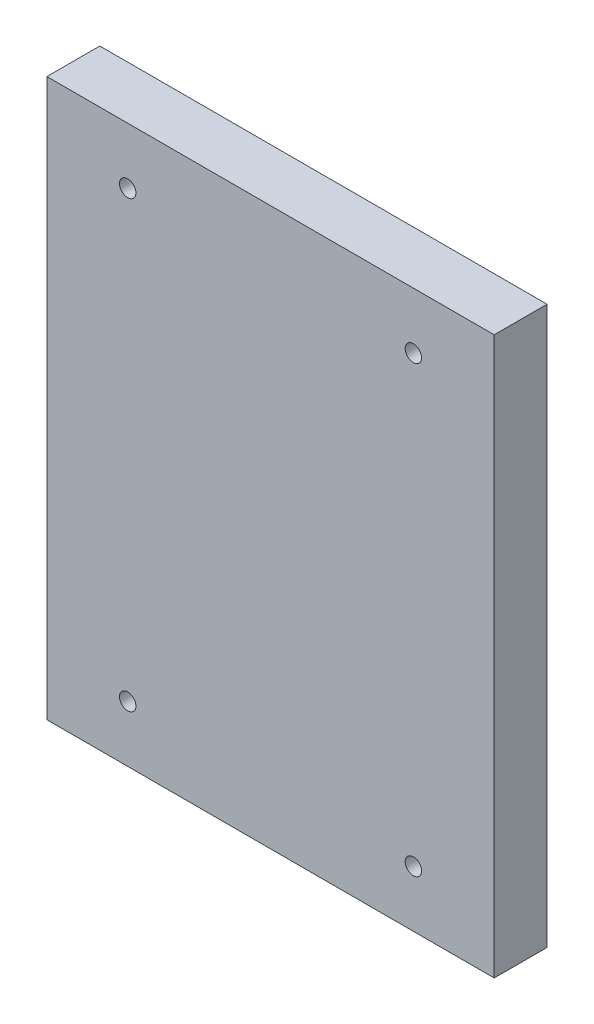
ISO-10303-21;
HEADER;
FILE_DESCRIPTION(('STEP AP214'),'2;1');
FILE_NAME('part.step','',(''),(''),'','','');
FILE_SCHEMA(('AUTOMOTIVE_DESIGN { 1 0 10303 214 1 1 1 1 }'));
ENDSEC;
DATA;
#1=APPLICATION_CONTEXT('core data for automotive mechanical design processes');
#2=APPLICATION_PROTOCOL_DEFINITION('international standard','automotive_design',2000,#1);
#3=PRODUCT_CONTEXT('',#1,'mechanical');
#4=PRODUCT('Part','Part','',(#3));
#5=PRODUCT_RELATED_PRODUCT_CATEGORY('part','',(#4));
#6=PRODUCT_DEFINITION_FORMATION('','',#4);
#7=PRODUCT_DEFINITION_CONTEXT('part definition',#1,'design');
#8=PRODUCT_DEFINITION('design','',#6,#7);
#9=PRODUCT_DEFINITION_SHAPE('','',#8);
#10=(LENGTH_UNIT() NAMED_UNIT(*) SI_UNIT(.MILLI.,.METRE.));
#11=(NAMED_UNIT(*) PLANE_ANGLE_UNIT() SI_UNIT($,.RADIAN.));
#12=(NAMED_UNIT(*) SI_UNIT($,.STERADIAN.) SOLID_ANGLE_UNIT());
#13=UNCERTAINTY_MEASURE_WITH_UNIT(LENGTH_MEASURE(1.E-05),#10,'distance_accuracy_value','');
#14=(GEOMETRIC_REPRESENTATION_CONTEXT(3) GLOBAL_UNCERTAINTY_ASSIGNED_CONTEXT((#13)) GLOBAL_UNIT_ASSIGNED_CONTEXT((#10,
#11,#12)) REPRESENTATION_CONTEXT('',''));
#15=CARTESIAN_POINT('',(0.,0.,0.));
#16=DIRECTION('',(0.,0.,1.));
#17=DIRECTION('',(1.,0.,0.));
#18=AXIS2_PLACEMENT_3D('',#15,#16,#17);
#19=CARTESIAN_POINT('',(0.,0.,10.));
#20=DIRECTION('',(0.,0.,1.));
#21=DIRECTION('',(1.,0.,0.));
#22=AXIS2_PLACEMENT_3D('',#19,#20,#21);
#23=PLANE('',#22);
#24=CARTESIAN_POINT('',(140.646889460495,2.2616220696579,10.));
#25=DIRECTION('',(0.,0.,1.));
#26=DIRECTION('',(1.,0.,0.));
#27=AXIS2_PLACEMENT_3D('',#24,#25,#26);
#28=CIRCLE('',#27,1.54999999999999);
#29=CARTESIAN_POINT('',(142.196889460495,2.2616220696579,10.));
#30=VERTEX_POINT('',#29);
#31=EDGE_CURVE('E121',#30,#30,#28,.T.);
#32=ORIENTED_EDGE('',*,*,#31,.F.);
#33=EDGE_LOOP('',(#32));
#34=FACE_BOUND('',#33,.T.);
#35=CARTESIAN_POINT('',(86.646889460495,86.2616220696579,10.));
#36=DIRECTION('',(0.,0.,1.));
#37=DIRECTION('',(1.,0.,0.));
#38=AXIS2_PLACEMENT_3D('',#35,#36,#37);
#39=CIRCLE('',#38,1.54999999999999);
#40=CARTESIAN_POINT('',(88.196889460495,86.2616220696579,10.));
#41=VERTEX_POINT('',#40);
#42=EDGE_CURVE('E100',#41,#41,#39,.T.);
#43=ORIENTED_EDGE('',*,*,#42,.F.);
#44=EDGE_LOOP('',(#43));
#45=FACE_BOUND('',#44,.T.);
#46=DIRECTION('',(0.,1.,0.));
#47=VECTOR('',#46,1.);
#48=CARTESIAN_POINT('',(155.921125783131,96.9072533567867,10.));
#49=LINE('',#48,#47);
#50=CARTESIAN_POINT('',(155.921125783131,-8.38400921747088,10.));
#51=VERTEX_POINT('',#50);
#52=CARTESIAN_POINT('',(155.921125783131,96.9072533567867,10.));
#53=VERTEX_POINT('',#52);
#54=EDGE_CURVE('E85',#51,#53,#49,.T.);
#55=ORIENTED_EDGE('',*,*,#54,.T.);
#56=DIRECTION('',(-1.,0.,0.));
#57=VECTOR('',#56,1.);
#58=CARTESIAN_POINT('',(71.372653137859,96.9072533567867,10.));
#59=LINE('',#58,#57);
#60=CARTESIAN_POINT('',(71.372653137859,96.9072533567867,10.));
#61=VERTEX_POINT('',#60);
#62=EDGE_CURVE('E80',#53,#61,#59,.T.);
#63=ORIENTED_EDGE('',*,*,#62,.T.);
#64=DIRECTION('',(0.,-1.,0.));
#65=VECTOR('',#64,1.);
#66=CARTESIAN_POINT('',(71.372653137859,96.9072533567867,10.));
#67=LINE('',#66,#65);
#68=CARTESIAN_POINT('',(71.372653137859,-8.38400921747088,10.));
#69=VERTEX_POINT('',#68);
#70=EDGE_CURVE('E83',#61,#69,#67,.T.);
#71=ORIENTED_EDGE('',*,*,#70,.T.);
#72=DIRECTION('',(1.,0.,0.));
#73=VECTOR('',#72,1.);
#74=CARTESIAN_POINT('',(71.372653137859,-8.38400921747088,10.));
#75=LINE('',#74,#73);
#76=EDGE_CURVE('E50',#69,#51,#75,.T.);
#77=ORIENTED_EDGE('',*,*,#76,.T.);
#78=EDGE_LOOP('',(#55,#63,#71,#77));
#79=FACE_BOUND('',#78,.T.);
#80=CARTESIAN_POINT('',(140.646889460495,86.2616220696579,10.));
#81=DIRECTION('',(0.,0.,1.));
#82=DIRECTION('',(1.,0.,0.));
#83=AXIS2_PLACEMENT_3D('',#80,#81,#82);
#84=CIRCLE('',#83,1.54999999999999);
#85=CARTESIAN_POINT('',(142.196889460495,86.2616220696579,10.));
#86=VERTEX_POINT('',#85);
#87=EDGE_CURVE('E115',#86,#86,#84,.T.);
#88=ORIENTED_EDGE('',*,*,#87,.F.);
#89=EDGE_LOOP('',(#88));
#90=FACE_BOUND('',#89,.T.);
#91=CARTESIAN_POINT('',(86.646889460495,2.2616220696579,10.));
#92=DIRECTION('',(0.,0.,1.));
#93=DIRECTION('',(1.,0.,0.));
#94=AXIS2_PLACEMENT_3D('',#91,#92,#93);
#95=CIRCLE('',#94,1.54999999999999);
#96=CARTESIAN_POINT('',(88.196889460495,2.2616220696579,10.));
#97=VERTEX_POINT('',#96);
#98=EDGE_CURVE('E127',#97,#97,#95,.T.);
#99=ORIENTED_EDGE('',*,*,#98,.F.);
#100=EDGE_LOOP('',(#99));
#101=FACE_BOUND('',#100,.T.);
#102=ADVANCED_FACE('F33',(#34,#45,#79,#90,#101),#23,.T.);
#103=CARTESIAN_POINT('',(0.,0.,0.));
#104=DIRECTION('',(0.,0.,1.));
#105=DIRECTION('',(1.,0.,0.));
#106=AXIS2_PLACEMENT_3D('',#103,#104,#105);
#107=PLANE('',#106);
#108=DIRECTION('',(0.,1.,0.));
#109=VECTOR('',#108,1.);
#110=CARTESIAN_POINT('',(155.921125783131,96.9072533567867,0.));
#111=LINE('',#110,#109);
#112=CARTESIAN_POINT('',(155.921125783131,-8.38400921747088,0.));
#113=VERTEX_POINT('',#112);
#114=CARTESIAN_POINT('',(155.921125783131,96.9072533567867,0.));
#115=VERTEX_POINT('',#114);
#116=EDGE_CURVE('E97',#113,#115,#111,.T.);
#117=ORIENTED_EDGE('',*,*,#116,.F.);
#118=DIRECTION('',(1.,0.,0.));
#119=VECTOR('',#118,1.);
#120=CARTESIAN_POINT('',(71.372653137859,-8.38400921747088,0.));
#121=LINE('',#120,#119);
#122=CARTESIAN_POINT('',(71.372653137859,-8.38400921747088,0.));
#123=VERTEX_POINT('',#122);
#124=EDGE_CURVE('E73',#123,#113,#121,.T.);
#125=ORIENTED_EDGE('',*,*,#124,.F.);
#126=DIRECTION('',(0.,-1.,0.));
#127=VECTOR('',#126,1.);
#128=CARTESIAN_POINT('',(71.372653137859,96.9072533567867,0.));
#129=LINE('',#128,#127);
#130=CARTESIAN_POINT('',(71.372653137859,96.9072533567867,0.));
#131=VERTEX_POINT('',#130);
#132=EDGE_CURVE('E67',#131,#123,#129,.T.);
#133=ORIENTED_EDGE('',*,*,#132,.F.);
#134=DIRECTION('',(-1.,0.,0.));
#135=VECTOR('',#134,1.);
#136=CARTESIAN_POINT('',(71.372653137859,96.9072533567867,0.));
#137=LINE('',#136,#135);
#138=EDGE_CURVE('E89',#115,#131,#137,.T.);
#139=ORIENTED_EDGE('',*,*,#138,.F.);
#140=EDGE_LOOP('',(#117,#125,#133,#139));
#141=FACE_BOUND('',#140,.T.);
#142=CARTESIAN_POINT('',(86.646889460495,86.2616220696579,0.));
#143=DIRECTION('',(0.,0.,1.));
#144=DIRECTION('',(1.,0.,0.));
#145=AXIS2_PLACEMENT_3D('',#142,#143,#144);
#146=CIRCLE('',#145,1.54999999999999);
#147=CARTESIAN_POINT('',(88.196889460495,86.2616220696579,0.));
#148=VERTEX_POINT('',#147);
#149=EDGE_CURVE('E112',#148,#148,#146,.T.);
#150=ORIENTED_EDGE('',*,*,#149,.T.);
#151=EDGE_LOOP('',(#150));
#152=FACE_BOUND('',#151,.T.);
#153=CARTESIAN_POINT('',(140.646889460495,86.2616220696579,0.));
#154=DIRECTION('',(0.,0.,1.));
#155=DIRECTION('',(1.,0.,0.));
#156=AXIS2_PLACEMENT_3D('',#153,#154,#155);
#157=CIRCLE('',#156,1.54999999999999);
#158=CARTESIAN_POINT('',(142.196889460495,86.2616220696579,0.));
#159=VERTEX_POINT('',#158);
#160=EDGE_CURVE('E118',#159,#159,#157,.T.);
#161=ORIENTED_EDGE('',*,*,#160,.T.);
#162=EDGE_LOOP('',(#161));
#163=FACE_BOUND('',#162,.T.);
#164=CARTESIAN_POINT('',(140.646889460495,2.2616220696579,0.));
#165=DIRECTION('',(0.,0.,1.));
#166=DIRECTION('',(1.,0.,0.));
#167=AXIS2_PLACEMENT_3D('',#164,#165,#166);
#168=CIRCLE('',#167,1.54999999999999);
#169=CARTESIAN_POINT('',(142.196889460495,2.2616220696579,0.));
#170=VERTEX_POINT('',#169);
#171=EDGE_CURVE('E124',#170,#170,#168,.T.);
#172=ORIENTED_EDGE('',*,*,#171,.T.);
#173=EDGE_LOOP('',(#172));
#174=FACE_BOUND('',#173,.T.);
#175=CARTESIAN_POINT('',(86.646889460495,2.2616220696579,0.));
#176=DIRECTION('',(0.,0.,1.));
#177=DIRECTION('',(1.,0.,0.));
#178=AXIS2_PLACEMENT_3D('',#175,#176,#177);
#179=CIRCLE('',#178,1.54999999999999);
#180=CARTESIAN_POINT('',(88.196889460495,2.2616220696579,0.));
#181=VERTEX_POINT('',#180);
#182=EDGE_CURVE('E130',#181,#181,#179,.T.);
#183=ORIENTED_EDGE('',*,*,#182,.T.);
#184=EDGE_LOOP('',(#183));
#185=FACE_BOUND('',#184,.T.);
#186=ADVANCED_FACE('F108',(#141,#152,#163,#174,#185),#107,.F.);
#187=CARTESIAN_POINT('',(155.921125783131,96.9072533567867,10.));
#188=DIRECTION('',(-1.,0.,0.));
#189=DIRECTION('',(0.,-1.,0.));
#190=AXIS2_PLACEMENT_3D('',#187,#188,#189);
#191=PLANE('',#190);
#192=ORIENTED_EDGE('',*,*,#116,.T.);
#193=DIRECTION('',(0.,0.,-1.));
#194=VECTOR('',#193,1.);
#195=CARTESIAN_POINT('',(155.921125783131,96.9072533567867,10.));
#196=LINE('',#195,#194);
#197=EDGE_CURVE('E11',#53,#115,#196,.T.);
#198=ORIENTED_EDGE('',*,*,#197,.F.);
#199=ORIENTED_EDGE('',*,*,#54,.F.);
#200=DIRECTION('',(0.,0.,-1.));
#201=VECTOR('',#200,1.);
#202=CARTESIAN_POINT('',(155.921125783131,-8.38400921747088,10.));
#203=LINE('',#202,#201);
#204=EDGE_CURVE('E93',#51,#113,#203,.T.);
#205=ORIENTED_EDGE('',*,*,#204,.T.);
#206=EDGE_LOOP('',(#192,#198,#199,#205));
#207=FACE_BOUND('',#206,.T.);
#208=ADVANCED_FACE('F35',(#207),#191,.F.);
#209=CARTESIAN_POINT('',(71.372653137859,96.9072533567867,10.));
#210=DIRECTION('',(0.,-1.,0.));
#211=DIRECTION('',(0.,0.,-1.));
#212=AXIS2_PLACEMENT_3D('',#209,#210,#211);
#213=PLANE('',#212);
#214=ORIENTED_EDGE('',*,*,#138,.T.);
#215=DIRECTION('',(0.,0.,-1.));
#216=VECTOR('',#215,1.);
#217=CARTESIAN_POINT('',(71.372653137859,96.9072533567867,10.));
#218=LINE('',#217,#216);
#219=EDGE_CURVE('E42',#61,#131,#218,.T.);
#220=ORIENTED_EDGE('',*,*,#219,.F.);
#221=ORIENTED_EDGE('',*,*,#62,.F.);
#222=ORIENTED_EDGE('',*,*,#197,.T.);
#223=EDGE_LOOP('',(#214,#220,#221,#222));
#224=FACE_BOUND('',#223,.T.);
#225=ADVANCED_FACE('F88',(#224),#213,.F.);
#226=CARTESIAN_POINT('',(71.372653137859,96.9072533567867,10.));
#227=DIRECTION('',(1.,0.,0.));
#228=DIRECTION('',(0.,1.,0.));
#229=AXIS2_PLACEMENT_3D('',#226,#227,#228);
#230=PLANE('',#229);
#231=ORIENTED_EDGE('',*,*,#132,.T.);
#232=DIRECTION('',(0.,0.,-1.));
#233=VECTOR('',#232,1.);
#234=CARTESIAN_POINT('',(71.372653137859,-8.38400921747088,10.));
#235=LINE('',#234,#233);
#236=EDGE_CURVE('E90',#69,#123,#235,.T.);
#237=ORIENTED_EDGE('',*,*,#236,.F.);
#238=ORIENTED_EDGE('',*,*,#70,.F.);
#239=ORIENTED_EDGE('',*,*,#219,.T.);
#240=EDGE_LOOP('',(#231,#237,#238,#239));
#241=FACE_BOUND('',#240,.T.);
#242=ADVANCED_FACE('F91',(#241),#230,.F.);
#243=CARTESIAN_POINT('',(71.372653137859,-8.38400921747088,10.));
#244=DIRECTION('',(0.,1.,0.));
#245=DIRECTION('',(0.,0.,1.));
#246=AXIS2_PLACEMENT_3D('',#243,#244,#245);
#247=PLANE('',#246);
#248=ORIENTED_EDGE('',*,*,#124,.T.);
#249=ORIENTED_EDGE('',*,*,#204,.F.);
#250=ORIENTED_EDGE('',*,*,#76,.F.);
#251=ORIENTED_EDGE('',*,*,#236,.T.);
#252=EDGE_LOOP('',(#248,#249,#250,#251));
#253=FACE_BOUND('',#252,.T.);
#254=ADVANCED_FACE('F105',(#253),#247,.F.);
#255=CARTESIAN_POINT('',(86.646889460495,86.2616220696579,10.));
#256=DIRECTION('',(0.,0.,-1.));
#257=DIRECTION('',(-1.,0.,0.));
#258=AXIS2_PLACEMENT_3D('',#255,#256,#257);
#259=CYLINDRICAL_SURFACE('',#258,1.54999999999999);
#260=ORIENTED_EDGE('',*,*,#42,.T.);
#261=EDGE_LOOP('',(#260));
#262=FACE_BOUND('',#261,.T.);
#263=ORIENTED_EDGE('',*,*,#149,.F.);
#264=EDGE_LOOP('',(#263));
#265=FACE_BOUND('',#264,.T.);
#266=ADVANCED_FACE('F149',(#262,#265),#259,.F.);
#267=CARTESIAN_POINT('',(140.646889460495,86.2616220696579,10.));
#268=DIRECTION('',(0.,0.,-1.));
#269=DIRECTION('',(-1.,0.,0.));
#270=AXIS2_PLACEMENT_3D('',#267,#268,#269);
#271=CYLINDRICAL_SURFACE('',#270,1.54999999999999);
#272=ORIENTED_EDGE('',*,*,#87,.T.);
#273=EDGE_LOOP('',(#272));
#274=FACE_BOUND('',#273,.T.);
#275=ORIENTED_EDGE('',*,*,#160,.F.);
#276=EDGE_LOOP('',(#275));
#277=FACE_BOUND('',#276,.T.);
#278=ADVANCED_FACE('F195',(#274,#277),#271,.F.);
#279=CARTESIAN_POINT('',(140.646889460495,2.2616220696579,10.));
#280=DIRECTION('',(0.,0.,-1.));
#281=DIRECTION('',(-1.,0.,0.));
#282=AXIS2_PLACEMENT_3D('',#279,#280,#281);
#283=CYLINDRICAL_SURFACE('',#282,1.54999999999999);
#284=ORIENTED_EDGE('',*,*,#31,.T.);
#285=EDGE_LOOP('',(#284));
#286=FACE_BOUND('',#285,.T.);
#287=ORIENTED_EDGE('',*,*,#171,.F.);
#288=EDGE_LOOP('',(#287));
#289=FACE_BOUND('',#288,.T.);
#290=ADVANCED_FACE('F203',(#286,#289),#283,.F.);
#291=CARTESIAN_POINT('',(86.646889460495,2.2616220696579,10.));
#292=DIRECTION('',(0.,0.,-1.));
#293=DIRECTION('',(-1.,0.,0.));
#294=AXIS2_PLACEMENT_3D('',#291,#292,#293);
#295=CYLINDRICAL_SURFACE('',#294,1.54999999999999);
#296=ORIENTED_EDGE('',*,*,#98,.T.);
#297=EDGE_LOOP('',(#296));
#298=FACE_BOUND('',#297,.T.);
#299=ORIENTED_EDGE('',*,*,#182,.F.);
#300=EDGE_LOOP('',(#299));
#301=FACE_BOUND('',#300,.T.);
#302=ADVANCED_FACE('F136',(#298,#301),#295,.F.);
#303=CLOSED_SHELL('',(#102,#186,#208,#225,#242,#254,#266,#278,#290,#302));
#304=MANIFOLD_SOLID_BREP('B2',#303);
#305=ADVANCED_BREP_SHAPE_REPRESENTATION('',(#18,#304),#14);
#306=SHAPE_DEFINITION_REPRESENTATION(#9,#305);
ENDSEC;
END-ISO-10303-21;
